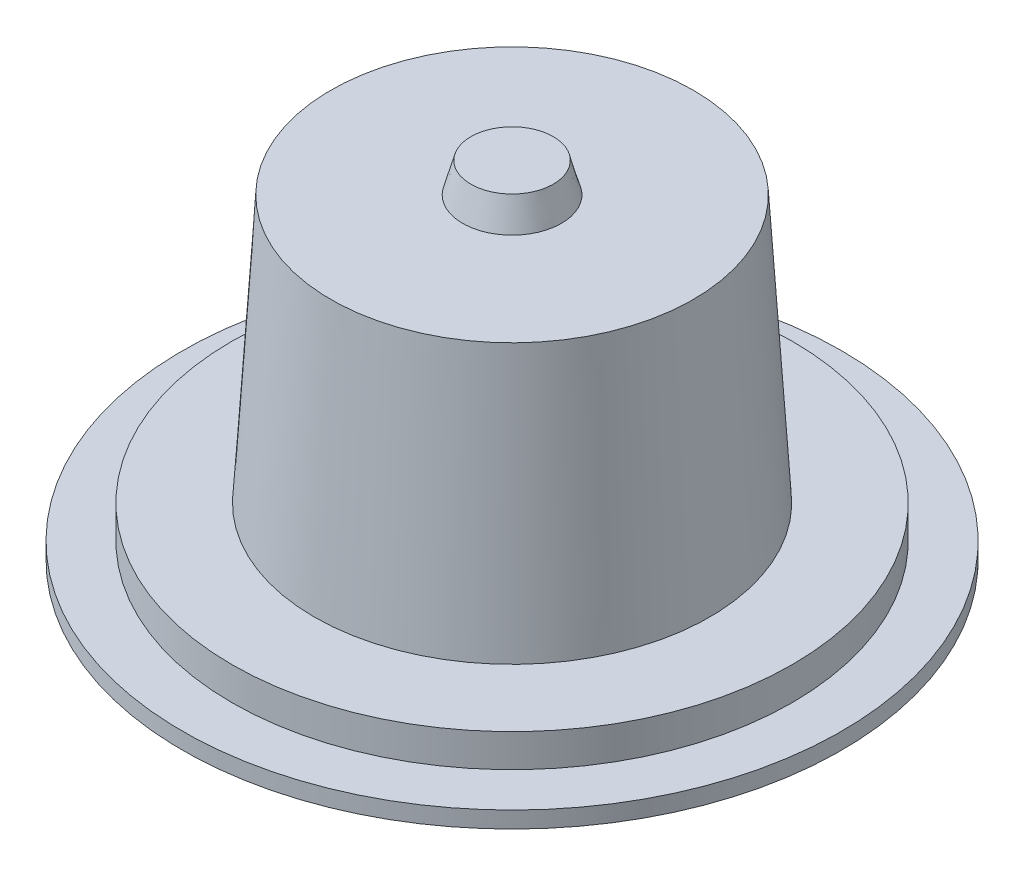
from build123d import *


with BuildPart() as part:
    # Croquis1 → Revoluci_n1 (revolve)
    with BuildSketch(Plane.XY, mode=Mode.PRIVATE) as revoluci_n1_sk:
        Polygon((-50, 0), (-90, 0), (-100, 5), (-100, 10), (-85, 10), (-85, 20), (-60, 20), (-55, 100.95632783), (-15, 100.95632783), (-12.5, 110), (0, 110), (0, 100.95632783), (0, 20), (0, 10), (-50, 10), align=None)
    revolve(revoluci_n1_sk.sketch.rotate(Axis((0, 0, 0), (0, 1, 0)), 270), axis=Axis((0, 0, 0), (0, 1, 0)))


solid = part.part
